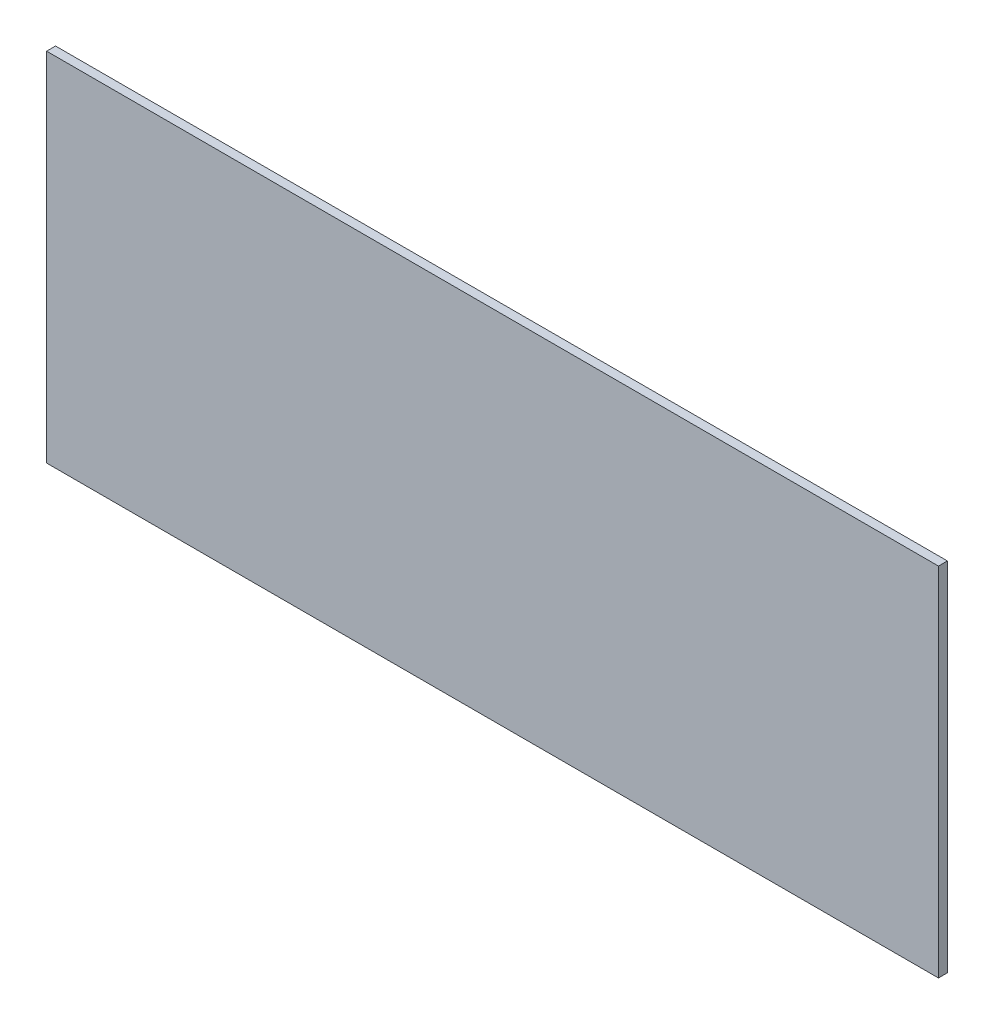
ISO-10303-21;
HEADER;
FILE_DESCRIPTION(('STEP AP214'),'2;1');
FILE_NAME('part.step','',(''),(''),'','','');
FILE_SCHEMA(('AUTOMOTIVE_DESIGN { 1 0 10303 214 1 1 1 1 }'));
ENDSEC;
DATA;
#1=APPLICATION_CONTEXT('core data for automotive mechanical design processes');
#2=APPLICATION_PROTOCOL_DEFINITION('international standard','automotive_design',2000,#1);
#3=PRODUCT_CONTEXT('',#1,'mechanical');
#4=PRODUCT('Part','Part','',(#3));
#5=PRODUCT_RELATED_PRODUCT_CATEGORY('part','',(#4));
#6=PRODUCT_DEFINITION_FORMATION('','',#4);
#7=PRODUCT_DEFINITION_CONTEXT('part definition',#1,'design');
#8=PRODUCT_DEFINITION('design','',#6,#7);
#9=PRODUCT_DEFINITION_SHAPE('','',#8);
#10=(LENGTH_UNIT() NAMED_UNIT(*) SI_UNIT(.MILLI.,.METRE.));
#11=(NAMED_UNIT(*) PLANE_ANGLE_UNIT() SI_UNIT($,.RADIAN.));
#12=(NAMED_UNIT(*) SI_UNIT($,.STERADIAN.) SOLID_ANGLE_UNIT());
#13=UNCERTAINTY_MEASURE_WITH_UNIT(LENGTH_MEASURE(1.E-05),#10,'distance_accuracy_value','');
#14=(GEOMETRIC_REPRESENTATION_CONTEXT(3) GLOBAL_UNCERTAINTY_ASSIGNED_CONTEXT((#13)) GLOBAL_UNIT_ASSIGNED_CONTEXT((#10,
#11,#12)) REPRESENTATION_CONTEXT('',''));
#15=CARTESIAN_POINT('',(0.,0.,0.));
#16=DIRECTION('',(0.,0.,1.));
#17=DIRECTION('',(1.,0.,0.));
#18=AXIS2_PLACEMENT_3D('',#15,#16,#17);
#19=CARTESIAN_POINT('',(0.,0.,0.1));
#20=DIRECTION('',(0.,1.,0.));
#21=DIRECTION('',(0.,0.,1.));
#22=AXIS2_PLACEMENT_3D('',#19,#20,#21);
#23=PLANE('',#22);
#24=DIRECTION('',(1.,0.,0.));
#25=VECTOR('',#24,1.);
#26=CARTESIAN_POINT('',(0.,0.,0.));
#27=LINE('',#26,#25);
#28=CARTESIAN_POINT('',(0.,0.,0.));
#29=VERTEX_POINT('',#28);
#30=CARTESIAN_POINT('',(10.,0.,0.));
#31=VERTEX_POINT('',#30);
#32=EDGE_CURVE('E110',#29,#31,#27,.T.);
#33=ORIENTED_EDGE('',*,*,#32,.T.);
#34=DIRECTION('',(0.,0.,-1.));
#35=VECTOR('',#34,1.);
#36=CARTESIAN_POINT('',(10.,0.,0.1));
#37=LINE('',#36,#35);
#38=CARTESIAN_POINT('',(10.,0.,0.1));
#39=VERTEX_POINT('',#38);
#40=EDGE_CURVE('E11',#39,#31,#37,.T.);
#41=ORIENTED_EDGE('',*,*,#40,.F.);
#42=DIRECTION('',(1.,0.,0.));
#43=VECTOR('',#42,1.);
#44=CARTESIAN_POINT('',(0.,0.,0.1));
#45=LINE('',#44,#43);
#46=CARTESIAN_POINT('',(0.,0.,0.1));
#47=VERTEX_POINT('',#46);
#48=EDGE_CURVE('E91',#47,#39,#45,.T.);
#49=ORIENTED_EDGE('',*,*,#48,.F.);
#50=DIRECTION('',(0.,0.,-1.));
#51=VECTOR('',#50,1.);
#52=CARTESIAN_POINT('',(0.,0.,0.1));
#53=LINE('',#52,#51);
#54=EDGE_CURVE('E58',#47,#29,#53,.T.);
#55=ORIENTED_EDGE('',*,*,#54,.T.);
#56=EDGE_LOOP('',(#33,#41,#49,#55));
#57=FACE_BOUND('',#56,.T.);
#58=ADVANCED_FACE('F41',(#57),#23,.F.);
#59=CARTESIAN_POINT('',(10.,0.,0.1));
#60=DIRECTION('',(-1.,0.,0.));
#61=DIRECTION('',(0.,0.,1.));
#62=AXIS2_PLACEMENT_3D('',#59,#60,#61);
#63=PLANE('',#62);
#64=DIRECTION('',(0.,1.,0.));
#65=VECTOR('',#64,1.);
#66=CARTESIAN_POINT('',(10.,0.,0.));
#67=LINE('',#66,#65);
#68=CARTESIAN_POINT('',(10.,4.,0.));
#69=VERTEX_POINT('',#68);
#70=EDGE_CURVE('E97',#31,#69,#67,.T.);
#71=ORIENTED_EDGE('',*,*,#70,.T.);
#72=DIRECTION('',(0.,0.,-1.));
#73=VECTOR('',#72,1.);
#74=CARTESIAN_POINT('',(10.,4.,0.1));
#75=LINE('',#74,#73);
#76=CARTESIAN_POINT('',(10.,4.,0.1));
#77=VERTEX_POINT('',#76);
#78=EDGE_CURVE('E50',#77,#69,#75,.T.);
#79=ORIENTED_EDGE('',*,*,#78,.F.);
#80=DIRECTION('',(0.,1.,0.));
#81=VECTOR('',#80,1.);
#82=CARTESIAN_POINT('',(10.,0.,0.1));
#83=LINE('',#82,#81);
#84=EDGE_CURVE('E83',#39,#77,#83,.T.);
#85=ORIENTED_EDGE('',*,*,#84,.F.);
#86=ORIENTED_EDGE('',*,*,#40,.T.);
#87=EDGE_LOOP('',(#71,#79,#85,#86));
#88=FACE_BOUND('',#87,.T.);
#89=ADVANCED_FACE('F96',(#88),#63,.F.);
#90=CARTESIAN_POINT('',(0.,4.,0.1));
#91=DIRECTION('',(0.,1.,0.));
#92=DIRECTION('',(0.,0.,1.));
#93=AXIS2_PLACEMENT_3D('',#90,#91,#92);
#94=PLANE('',#93);
#95=DIRECTION('',(1.,0.,0.));
#96=VECTOR('',#95,1.);
#97=CARTESIAN_POINT('',(0.,4.,0.));
#98=LINE('',#97,#96);
#99=CARTESIAN_POINT('',(0.,4.,0.));
#100=VERTEX_POINT('',#99);
#101=EDGE_CURVE('E115',#100,#69,#98,.T.);
#102=ORIENTED_EDGE('',*,*,#101,.F.);
#103=DIRECTION('',(0.,0.,-1.));
#104=VECTOR('',#103,1.);
#105=CARTESIAN_POINT('',(0.,4.,0.1));
#106=LINE('',#105,#104);
#107=CARTESIAN_POINT('',(0.,4.,0.1));
#108=VERTEX_POINT('',#107);
#109=EDGE_CURVE('E72',#108,#100,#106,.T.);
#110=ORIENTED_EDGE('',*,*,#109,.F.);
#111=DIRECTION('',(1.,0.,0.));
#112=VECTOR('',#111,1.);
#113=CARTESIAN_POINT('',(0.,4.,0.1));
#114=LINE('',#113,#112);
#115=EDGE_CURVE('E90',#108,#77,#114,.T.);
#116=ORIENTED_EDGE('',*,*,#115,.T.);
#117=ORIENTED_EDGE('',*,*,#78,.T.);
#118=EDGE_LOOP('',(#102,#110,#116,#117));
#119=FACE_BOUND('',#118,.T.);
#120=ADVANCED_FACE('F101',(#119),#94,.T.);
#121=CARTESIAN_POINT('',(0.,0.,0.1));
#122=DIRECTION('',(-1.,0.,0.));
#123=DIRECTION('',(0.,0.,1.));
#124=AXIS2_PLACEMENT_3D('',#121,#122,#123);
#125=PLANE('',#124);
#126=DIRECTION('',(0.,1.,0.));
#127=VECTOR('',#126,1.);
#128=CARTESIAN_POINT('',(0.,0.,0.));
#129=LINE('',#128,#127);
#130=EDGE_CURVE('E118',#29,#100,#129,.T.);
#131=ORIENTED_EDGE('',*,*,#130,.F.);
#132=ORIENTED_EDGE('',*,*,#54,.F.);
#133=DIRECTION('',(0.,1.,0.));
#134=VECTOR('',#133,1.);
#135=CARTESIAN_POINT('',(0.,0.,0.1));
#136=LINE('',#135,#134);
#137=EDGE_CURVE('E103',#47,#108,#136,.T.);
#138=ORIENTED_EDGE('',*,*,#137,.T.);
#139=ORIENTED_EDGE('',*,*,#109,.T.);
#140=EDGE_LOOP('',(#131,#132,#138,#139));
#141=FACE_BOUND('',#140,.T.);
#142=ADVANCED_FACE('F136',(#141),#125,.T.);
#143=CARTESIAN_POINT('',(0.,0.,0.1));
#144=DIRECTION('',(0.,0.,1.));
#145=DIRECTION('',(1.,0.,0.));
#146=AXIS2_PLACEMENT_3D('',#143,#144,#145);
#147=PLANE('',#146);
#148=ORIENTED_EDGE('',*,*,#48,.T.);
#149=ORIENTED_EDGE('',*,*,#84,.T.);
#150=ORIENTED_EDGE('',*,*,#115,.F.);
#151=ORIENTED_EDGE('',*,*,#137,.F.);
#152=EDGE_LOOP('',(#148,#149,#150,#151));
#153=FACE_BOUND('',#152,.T.);
#154=ADVANCED_FACE('F87',(#153),#147,.T.);
#155=CARTESIAN_POINT('',(0.,0.,0.));
#156=DIRECTION('',(0.,0.,1.));
#157=DIRECTION('',(1.,0.,0.));
#158=AXIS2_PLACEMENT_3D('',#155,#156,#157);
#159=PLANE('',#158);
#160=ORIENTED_EDGE('',*,*,#32,.F.);
#161=ORIENTED_EDGE('',*,*,#130,.T.);
#162=ORIENTED_EDGE('',*,*,#101,.T.);
#163=ORIENTED_EDGE('',*,*,#70,.F.);
#164=EDGE_LOOP('',(#160,#161,#162,#163));
#165=FACE_BOUND('',#164,.T.);
#166=ADVANCED_FACE('F135',(#165),#159,.F.);
#167=CLOSED_SHELL('',(#58,#89,#120,#142,#154,#166));
#168=MANIFOLD_SOLID_BREP('B2',#167);
#169=ADVANCED_BREP_SHAPE_REPRESENTATION('',(#18,#168),#14);
#170=SHAPE_DEFINITION_REPRESENTATION(#9,#169);
ENDSEC;
END-ISO-10303-21;
